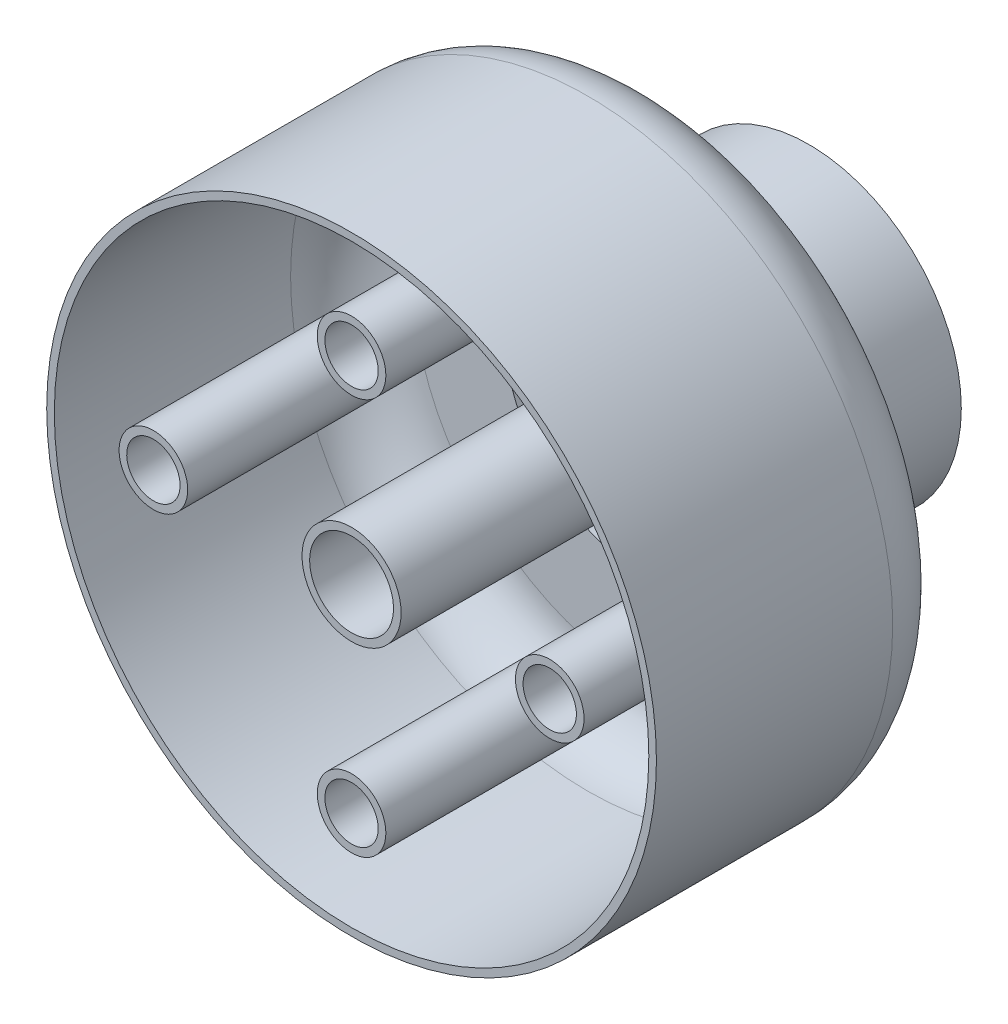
ISO-10303-21;
HEADER;
FILE_DESCRIPTION(('STEP AP214'),'2;1');
FILE_NAME('part.step','',(''),(''),'','','');
FILE_SCHEMA(('AUTOMOTIVE_DESIGN { 1 0 10303 214 1 1 1 1 }'));
ENDSEC;
DATA;
#1=APPLICATION_CONTEXT('core data for automotive mechanical design processes');
#2=APPLICATION_PROTOCOL_DEFINITION('international standard','automotive_design',2000,#1);
#3=PRODUCT_CONTEXT('',#1,'mechanical');
#4=PRODUCT('Part','Part','',(#3));
#5=PRODUCT_RELATED_PRODUCT_CATEGORY('part','',(#4));
#6=PRODUCT_DEFINITION_FORMATION('','',#4);
#7=PRODUCT_DEFINITION_CONTEXT('part definition',#1,'design');
#8=PRODUCT_DEFINITION('design','',#6,#7);
#9=PRODUCT_DEFINITION_SHAPE('','',#8);
#10=(LENGTH_UNIT() NAMED_UNIT(*) SI_UNIT(.MILLI.,.METRE.));
#11=(NAMED_UNIT(*) PLANE_ANGLE_UNIT() SI_UNIT($,.RADIAN.));
#12=(NAMED_UNIT(*) SI_UNIT($,.STERADIAN.) SOLID_ANGLE_UNIT());
#13=UNCERTAINTY_MEASURE_WITH_UNIT(LENGTH_MEASURE(1.E-05),#10,'distance_accuracy_value','');
#14=(GEOMETRIC_REPRESENTATION_CONTEXT(3) GLOBAL_UNCERTAINTY_ASSIGNED_CONTEXT((#13)) GLOBAL_UNIT_ASSIGNED_CONTEXT((#10,
#11,#12)) REPRESENTATION_CONTEXT('',''));
#15=CARTESIAN_POINT('',(0.,0.,0.));
#16=DIRECTION('',(0.,0.,1.));
#17=DIRECTION('',(1.,0.,0.));
#18=AXIS2_PLACEMENT_3D('',#15,#16,#17);
#19=CARTESIAN_POINT('',(0.,0.,15.));
#20=DIRECTION('',(0.,0.,1.));
#21=DIRECTION('',(1.,0.,0.));
#22=AXIS2_PLACEMENT_3D('',#19,#20,#21);
#23=PLANE('',#22);
#24=CARTESIAN_POINT('',(-6.5,0.,15.));
#25=DIRECTION('',(0.,0.,1.));
#26=DIRECTION('',(0.,1.,0.));
#27=AXIS2_PLACEMENT_3D('',#24,#25,#26);
#28=CIRCLE('',#27,0.875);
#29=CARTESIAN_POINT('',(-6.49999999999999,0.875000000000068,15.));
#30=VERTEX_POINT('',#29);
#31=EDGE_CURVE('E94',#30,#30,#28,.T.);
#32=ORIENTED_EDGE('',*,*,#31,.F.);
#33=EDGE_LOOP('',(#32));
#34=FACE_BOUND('',#33,.T.);
#35=CARTESIAN_POINT('',(-6.5,0.,15.));
#36=DIRECTION('',(0.,0.,1.));
#37=DIRECTION('',(1.,0.,0.));
#38=AXIS2_PLACEMENT_3D('',#35,#36,#37);
#39=CIRCLE('',#38,1.125);
#40=CARTESIAN_POINT('',(-5.375,0.,15.));
#41=VERTEX_POINT('',#40);
#42=EDGE_CURVE('E110',#41,#41,#39,.T.);
#43=ORIENTED_EDGE('',*,*,#42,.T.);
#44=EDGE_LOOP('',(#43));
#45=FACE_BOUND('',#44,.T.);
#46=ADVANCED_FACE('F32',(#34,#45),#23,.T.);
#47=CARTESIAN_POINT('',(0.,-6.5,15.));
#48=DIRECTION('',(0.,0.,1.));
#49=DIRECTION('',(-1.,0.,0.));
#50=AXIS2_PLACEMENT_3D('',#47,#48,#49);
#51=CIRCLE('',#50,0.875);
#52=CARTESIAN_POINT('',(-0.875,-6.5,15.));
#53=VERTEX_POINT('',#52);
#54=EDGE_CURVE('E88',#53,#53,#51,.T.);
#55=ORIENTED_EDGE('',*,*,#54,.F.);
#56=EDGE_LOOP('',(#55));
#57=FACE_BOUND('',#56,.T.);
#58=CARTESIAN_POINT('',(0.,-6.5,15.));
#59=DIRECTION('',(0.,0.,1.));
#60=DIRECTION('',(1.,0.,0.));
#61=AXIS2_PLACEMENT_3D('',#58,#59,#60);
#62=CIRCLE('',#61,1.125);
#63=CARTESIAN_POINT('',(1.125,-6.5,15.));
#64=VERTEX_POINT('',#63);
#65=EDGE_CURVE('E114',#64,#64,#62,.T.);
#66=ORIENTED_EDGE('',*,*,#65,.T.);
#67=EDGE_LOOP('',(#66));
#68=FACE_BOUND('',#67,.T.);
#69=ADVANCED_FACE('F162',(#57,#68),#23,.T.);
#70=CARTESIAN_POINT('',(6.5,0.,15.));
#71=DIRECTION('',(0.,0.,1.));
#72=DIRECTION('',(0.,-1.,0.));
#73=AXIS2_PLACEMENT_3D('',#70,#71,#72);
#74=CIRCLE('',#73,0.875);
#75=CARTESIAN_POINT('',(6.5,-0.875000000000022,15.));
#76=VERTEX_POINT('',#75);
#77=EDGE_CURVE('E82',#76,#76,#74,.T.);
#78=ORIENTED_EDGE('',*,*,#77,.F.);
#79=EDGE_LOOP('',(#78));
#80=FACE_BOUND('',#79,.T.);
#81=CARTESIAN_POINT('',(6.5,0.,15.));
#82=DIRECTION('',(0.,0.,1.));
#83=DIRECTION('',(1.,0.,0.));
#84=AXIS2_PLACEMENT_3D('',#81,#82,#83);
#85=CIRCLE('',#84,1.125);
#86=CARTESIAN_POINT('',(7.625,0.,15.));
#87=VERTEX_POINT('',#86);
#88=EDGE_CURVE('E118',#87,#87,#85,.T.);
#89=ORIENTED_EDGE('',*,*,#88,.T.);
#90=EDGE_LOOP('',(#89));
#91=FACE_BOUND('',#90,.T.);
#92=ADVANCED_FACE('F169',(#80,#91),#23,.T.);
#93=CARTESIAN_POINT('',(0.,6.5,15.));
#94=DIRECTION('',(0.,0.,1.));
#95=DIRECTION('',(1.,0.,0.));
#96=AXIS2_PLACEMENT_3D('',#93,#94,#95);
#97=CIRCLE('',#96,0.875);
#98=CARTESIAN_POINT('',(0.875,6.5,15.));
#99=VERTEX_POINT('',#98);
#100=EDGE_CURVE('E76',#99,#99,#97,.T.);
#101=ORIENTED_EDGE('',*,*,#100,.F.);
#102=EDGE_LOOP('',(#101));
#103=FACE_BOUND('',#102,.T.);
#104=CARTESIAN_POINT('',(0.,6.5,15.));
#105=DIRECTION('',(0.,0.,1.));
#106=DIRECTION('',(1.,0.,0.));
#107=AXIS2_PLACEMENT_3D('',#104,#105,#106);
#108=CIRCLE('',#107,1.125);
#109=CARTESIAN_POINT('',(1.125,6.5,15.));
#110=VERTEX_POINT('',#109);
#111=EDGE_CURVE('E122',#110,#110,#108,.T.);
#112=ORIENTED_EDGE('',*,*,#111,.T.);
#113=EDGE_LOOP('',(#112));
#114=FACE_BOUND('',#113,.T.);
#115=ADVANCED_FACE('F192',(#103,#114),#23,.T.);
#116=CARTESIAN_POINT('',(0.,0.,15.));
#117=DIRECTION('',(0.,0.,1.));
#118=DIRECTION('',(1.,0.,0.));
#119=AXIS2_PLACEMENT_3D('',#116,#117,#118);
#120=CIRCLE('',#119,1.625);
#121=CARTESIAN_POINT('',(1.625,0.,15.));
#122=VERTEX_POINT('',#121);
#123=EDGE_CURVE('E101',#122,#122,#120,.F.);
#124=ORIENTED_EDGE('',*,*,#123,.F.);
#125=EDGE_LOOP('',(#124));
#126=FACE_BOUND('',#125,.T.);
#127=CARTESIAN_POINT('',(0.,0.,15.));
#128=DIRECTION('',(0.,0.,-1.));
#129=DIRECTION('',(-1.,0.,0.));
#130=AXIS2_PLACEMENT_3D('',#127,#128,#129);
#131=CIRCLE('',#130,1.375);
#132=CARTESIAN_POINT('',(-1.375,0.,15.));
#133=VERTEX_POINT('',#132);
#134=EDGE_CURVE('E65',#133,#133,#131,.T.);
#135=ORIENTED_EDGE('',*,*,#134,.T.);
#136=EDGE_LOOP('',(#135));
#137=FACE_BOUND('',#136,.T.);
#138=ADVANCED_FACE('F179',(#126,#137),#23,.T.);
#139=CARTESIAN_POINT('',(0.,0.,1.));
#140=DIRECTION('',(0.,0.,-1.));
#141=DIRECTION('',(-1.,0.,0.));
#142=AXIS2_PLACEMENT_3D('',#139,#140,#141);
#143=PLANE('',#142);
#144=CARTESIAN_POINT('',(0.,0.,1.));
#145=DIRECTION('',(0.,0.,-1.));
#146=DIRECTION('',(-1.,0.,0.));
#147=AXIS2_PLACEMENT_3D('',#144,#145,#146);
#148=CIRCLE('',#147,4.75);
#149=CARTESIAN_POINT('',(-4.75,0.,1.));
#150=VERTEX_POINT('',#149);
#151=EDGE_CURVE('E55',#150,#150,#148,.T.);
#152=ORIENTED_EDGE('',*,*,#151,.T.);
#153=EDGE_LOOP('',(#152));
#154=FACE_BOUND('',#153,.T.);
#155=CARTESIAN_POINT('',(0.,0.,1.));
#156=DIRECTION('',(0.,0.,-1.));
#157=DIRECTION('',(-1.,0.,0.));
#158=AXIS2_PLACEMENT_3D('',#155,#156,#157);
#159=CIRCLE('',#158,1.875);
#160=CARTESIAN_POINT('',(-1.875,0.,1.));
#161=VERTEX_POINT('',#160);
#162=EDGE_CURVE('E62',#161,#161,#159,.T.);
#163=ORIENTED_EDGE('',*,*,#162,.F.);
#164=EDGE_LOOP('',(#163));
#165=FACE_BOUND('',#164,.T.);
#166=ADVANCED_FACE('F191',(#154,#165),#143,.T.);
#167=CARTESIAN_POINT('',(0.,0.,5.));
#168=DIRECTION('',(0.,0.,-1.));
#169=DIRECTION('',(-1.,0.,0.));
#170=AXIS2_PLACEMENT_3D('',#167,#168,#169);
#171=CYLINDRICAL_SURFACE('',#170,5.);
#172=CARTESIAN_POINT('',(0.,0.,5.));
#173=DIRECTION('',(0.,0.,1.));
#174=DIRECTION('',(1.,0.,0.));
#175=AXIS2_PLACEMENT_3D('',#172,#173,#174);
#176=CIRCLE('',#175,5.);
#177=CARTESIAN_POINT('',(5.,0.,5.));
#178=VERTEX_POINT('',#177);
#179=EDGE_CURVE('E43',#178,#178,#176,.T.);
#180=ORIENTED_EDGE('',*,*,#179,.F.);
#181=EDGE_LOOP('',(#180));
#182=FACE_BOUND('',#181,.T.);
#183=CARTESIAN_POINT('',(0.,0.,0.));
#184=DIRECTION('',(0.,0.,1.));
#185=DIRECTION('',(1.,0.,0.));
#186=AXIS2_PLACEMENT_3D('',#183,#184,#185);
#187=CIRCLE('',#186,5.);
#188=CARTESIAN_POINT('',(5.,0.,0.));
#189=VERTEX_POINT('',#188);
#190=EDGE_CURVE('E47',#189,#189,#187,.T.);
#191=ORIENTED_EDGE('',*,*,#190,.T.);
#192=EDGE_LOOP('',(#191));
#193=FACE_BOUND('',#192,.T.);
#194=ADVANCED_FACE('F198',(#182,#193),#171,.T.);
#195=CARTESIAN_POINT('',(0.,0.,0.));
#196=DIRECTION('',(0.,0.,1.));
#197=DIRECTION('',(1.,0.,0.));
#198=AXIS2_PLACEMENT_3D('',#195,#196,#197);
#199=PLANE('',#198);
#200=CARTESIAN_POINT('',(0.,0.,0.));
#201=DIRECTION('',(0.,0.,-1.));
#202=DIRECTION('',(-1.,0.,0.));
#203=AXIS2_PLACEMENT_3D('',#200,#201,#202);
#204=CIRCLE('',#203,4.75);
#205=CARTESIAN_POINT('',(-4.75,0.,0.));
#206=VERTEX_POINT('',#205);
#207=EDGE_CURVE('E56',#206,#206,#204,.T.);
#208=ORIENTED_EDGE('',*,*,#207,.F.);
#209=EDGE_LOOP('',(#208));
#210=FACE_BOUND('',#209,.T.);
#211=ORIENTED_EDGE('',*,*,#190,.F.);
#212=EDGE_LOOP('',(#211));
#213=FACE_BOUND('',#212,.T.);
#214=ADVANCED_FACE('F436',(#210,#213),#199,.F.);
#215=CARTESIAN_POINT('',(0.,0.,5.));
#216=DIRECTION('',(0.,0.,1.));
#217=DIRECTION('',(1.,0.,0.));
#218=AXIS2_PLACEMENT_3D('',#215,#216,#217);
#219=PLANE('',#218);
#220=CARTESIAN_POINT('',(0.,0.,5.));
#221=DIRECTION('',(0.,0.,1.));
#222=DIRECTION('',(1.,0.,0.));
#223=AXIS2_PLACEMENT_3D('',#220,#221,#222);
#224=CIRCLE('',#223,7.75);
#225=CARTESIAN_POINT('',(7.75,0.,5.));
#226=VERTEX_POINT('',#225);
#227=EDGE_CURVE('E10',#226,#226,#224,.F.);
#228=ORIENTED_EDGE('',*,*,#227,.T.);
#229=EDGE_LOOP('',(#228));
#230=FACE_BOUND('',#229,.T.);
#231=CARTESIAN_POINT('',(-6.5,0.,5.));
#232=DIRECTION('',(0.,0.,1.));
#233=DIRECTION('',(1.,0.,0.));
#234=AXIS2_PLACEMENT_3D('',#231,#232,#233);
#235=CIRCLE('',#234,0.875);
#236=CARTESIAN_POINT('',(-5.625,0.,5.));
#237=VERTEX_POINT('',#236);
#238=EDGE_CURVE('E91',#237,#237,#235,.T.);
#239=ORIENTED_EDGE('',*,*,#238,.T.);
#240=EDGE_LOOP('',(#239));
#241=FACE_BOUND('',#240,.T.);
#242=CARTESIAN_POINT('',(0.,-6.5,5.));
#243=DIRECTION('',(0.,0.,1.));
#244=DIRECTION('',(1.,0.,0.));
#245=AXIS2_PLACEMENT_3D('',#242,#243,#244);
#246=CIRCLE('',#245,0.875);
#247=CARTESIAN_POINT('',(0.875,-6.5,5.));
#248=VERTEX_POINT('',#247);
#249=EDGE_CURVE('E85',#248,#248,#246,.T.);
#250=ORIENTED_EDGE('',*,*,#249,.T.);
#251=EDGE_LOOP('',(#250));
#252=FACE_BOUND('',#251,.T.);
#253=CARTESIAN_POINT('',(6.5,0.,5.));
#254=DIRECTION('',(0.,0.,1.));
#255=DIRECTION('',(1.,0.,0.));
#256=AXIS2_PLACEMENT_3D('',#253,#254,#255);
#257=CIRCLE('',#256,0.875);
#258=CARTESIAN_POINT('',(7.375,0.,5.));
#259=VERTEX_POINT('',#258);
#260=EDGE_CURVE('E79',#259,#259,#257,.T.);
#261=ORIENTED_EDGE('',*,*,#260,.T.);
#262=EDGE_LOOP('',(#261));
#263=FACE_BOUND('',#262,.T.);
#264=CARTESIAN_POINT('',(0.,6.5,5.));
#265=DIRECTION('',(0.,0.,1.));
#266=DIRECTION('',(1.,0.,0.));
#267=AXIS2_PLACEMENT_3D('',#264,#265,#266);
#268=CIRCLE('',#267,0.875);
#269=CARTESIAN_POINT('',(0.875,6.5,5.));
#270=VERTEX_POINT('',#269);
#271=EDGE_CURVE('E71',#270,#270,#268,.T.);
#272=ORIENTED_EDGE('',*,*,#271,.T.);
#273=EDGE_LOOP('',(#272));
#274=FACE_BOUND('',#273,.T.);
#275=ORIENTED_EDGE('',*,*,#179,.T.);
#276=EDGE_LOOP('',(#275));
#277=FACE_BOUND('',#276,.T.);
#278=ADVANCED_FACE('F186',(#230,#241,#252,#263,#274,#277),#219,.F.);
#279=CARTESIAN_POINT('',(0.,0.,15.));
#280=DIRECTION('',(0.,0.,-1.));
#281=DIRECTION('',(-1.,0.,0.));
#282=AXIS2_PLACEMENT_3D('',#279,#280,#281);
#283=CYLINDRICAL_SURFACE('',#282,10.);
#284=CARTESIAN_POINT('',(0.,0.,7.25));
#285=DIRECTION('',(0.,0.,1.));
#286=DIRECTION('',(1.,0.,0.));
#287=AXIS2_PLACEMENT_3D('',#284,#285,#286);
#288=CIRCLE('',#287,10.);
#289=CARTESIAN_POINT('',(10.,0.,7.25));
#290=VERTEX_POINT('',#289);
#291=EDGE_CURVE('E39',#290,#290,#288,.T.);
#292=ORIENTED_EDGE('',*,*,#291,.T.);
#293=EDGE_LOOP('',(#292));
#294=FACE_BOUND('',#293,.T.);
#295=CARTESIAN_POINT('',(0.,0.,15.));
#296=DIRECTION('',(0.,0.,1.));
#297=DIRECTION('',(1.,0.,0.));
#298=AXIS2_PLACEMENT_3D('',#295,#296,#297);
#299=CIRCLE('',#298,10.);
#300=CARTESIAN_POINT('',(10.,0.,15.));
#301=VERTEX_POINT('',#300);
#302=EDGE_CURVE('E51',#301,#301,#299,.T.);
#303=ORIENTED_EDGE('',*,*,#302,.F.);
#304=EDGE_LOOP('',(#303));
#305=FACE_BOUND('',#304,.T.);
#306=ADVANCED_FACE('F177',(#294,#305),#283,.T.);
#307=CARTESIAN_POINT('',(0.,0.,15.));
#308=DIRECTION('',(0.,0.,1.));
#309=DIRECTION('',(1.,0.,0.));
#310=AXIS2_PLACEMENT_3D('',#307,#308,#309);
#311=CIRCLE('',#310,9.75);
#312=CARTESIAN_POINT('',(9.75,0.,15.));
#313=VERTEX_POINT('',#312);
#314=EDGE_CURVE('E106',#313,#313,#311,.T.);
#315=ORIENTED_EDGE('',*,*,#314,.F.);
#316=EDGE_LOOP('',(#315));
#317=FACE_BOUND('',#316,.T.);
#318=ORIENTED_EDGE('',*,*,#302,.T.);
#319=EDGE_LOOP('',(#318));
#320=FACE_BOUND('',#319,.T.);
#321=ADVANCED_FACE('F165',(#317,#320),#23,.T.);
#322=CARTESIAN_POINT('',(0.,0.,1.));
#323=DIRECTION('',(0.,0.,-1.));
#324=DIRECTION('',(-1.,0.,0.));
#325=AXIS2_PLACEMENT_3D('',#322,#323,#324);
#326=CYLINDRICAL_SURFACE('',#325,4.75);
#327=ORIENTED_EDGE('',*,*,#151,.F.);
#328=EDGE_LOOP('',(#327));
#329=FACE_BOUND('',#328,.T.);
#330=ORIENTED_EDGE('',*,*,#207,.T.);
#331=EDGE_LOOP('',(#330));
#332=FACE_BOUND('',#331,.T.);
#333=ADVANCED_FACE('F176',(#329,#332),#326,.F.);
#334=CARTESIAN_POINT('',(0.,0.,0.75));
#335=DIRECTION('',(0.,0.,1.));
#336=DIRECTION('',(1.,0.,0.));
#337=AXIS2_PLACEMENT_3D('',#334,#335,#336);
#338=CYLINDRICAL_SURFACE('',#337,1.875);
#339=CARTESIAN_POINT('',(0.,0.,0.75));
#340=DIRECTION('',(0.,0.,-1.));
#341=DIRECTION('',(-1.,0.,0.));
#342=AXIS2_PLACEMENT_3D('',#339,#340,#341);
#343=CIRCLE('',#342,1.875);
#344=CARTESIAN_POINT('',(-1.875,0.,0.75));
#345=VERTEX_POINT('',#344);
#346=EDGE_CURVE('E59',#345,#345,#343,.T.);
#347=ORIENTED_EDGE('',*,*,#346,.F.);
#348=EDGE_LOOP('',(#347));
#349=FACE_BOUND('',#348,.T.);
#350=ORIENTED_EDGE('',*,*,#162,.T.);
#351=EDGE_LOOP('',(#350));
#352=FACE_BOUND('',#351,.T.);
#353=ADVANCED_FACE('F184',(#349,#352),#338,.T.);
#354=CARTESIAN_POINT('',(0.,0.,0.75));
#355=DIRECTION('',(0.,0.,-1.));
#356=DIRECTION('',(-1.,0.,0.));
#357=AXIS2_PLACEMENT_3D('',#354,#355,#356);
#358=PLANE('',#357);
#359=CARTESIAN_POINT('',(0.,0.,0.75));
#360=DIRECTION('',(0.,0.,-1.));
#361=DIRECTION('',(-1.,0.,0.));
#362=AXIS2_PLACEMENT_3D('',#359,#360,#361);
#363=CIRCLE('',#362,1.375);
#364=CARTESIAN_POINT('',(-1.375,0.,0.75));
#365=VERTEX_POINT('',#364);
#366=EDGE_CURVE('E68',#365,#365,#363,.T.);
#367=ORIENTED_EDGE('',*,*,#366,.F.);
#368=EDGE_LOOP('',(#367));
#369=FACE_BOUND('',#368,.T.);
#370=ORIENTED_EDGE('',*,*,#346,.T.);
#371=EDGE_LOOP('',(#370));
#372=FACE_BOUND('',#371,.T.);
#373=ADVANCED_FACE('F210',(#369,#372),#358,.T.);
#374=CARTESIAN_POINT('',(0.,0.,15.));
#375=DIRECTION('',(0.,0.,-1.));
#376=DIRECTION('',(-1.,0.,0.));
#377=AXIS2_PLACEMENT_3D('',#374,#375,#376);
#378=CYLINDRICAL_SURFACE('',#377,1.375);
#379=ORIENTED_EDGE('',*,*,#134,.F.);
#380=EDGE_LOOP('',(#379));
#381=FACE_BOUND('',#380,.T.);
#382=ORIENTED_EDGE('',*,*,#366,.T.);
#383=EDGE_LOOP('',(#382));
#384=FACE_BOUND('',#383,.T.);
#385=ADVANCED_FACE('F206',(#381,#384),#378,.F.);
#386=CARTESIAN_POINT('',(0.,6.5,0.));
#387=DIRECTION('',(0.,0.,1.));
#388=DIRECTION('',(1.,0.,0.));
#389=AXIS2_PLACEMENT_3D('',#386,#387,#388);
#390=CYLINDRICAL_SURFACE('',#389,0.875);
#391=ORIENTED_EDGE('',*,*,#100,.T.);
#392=EDGE_LOOP('',(#391));
#393=FACE_BOUND('',#392,.T.);
#394=ORIENTED_EDGE('',*,*,#271,.F.);
#395=EDGE_LOOP('',(#394));
#396=FACE_BOUND('',#395,.T.);
#397=ADVANCED_FACE('F209',(#393,#396),#390,.F.);
#398=CARTESIAN_POINT('',(6.5,0.,0.));
#399=DIRECTION('',(0.,0.,1.));
#400=DIRECTION('',(1.,0.,0.));
#401=AXIS2_PLACEMENT_3D('',#398,#399,#400);
#402=CYLINDRICAL_SURFACE('',#401,0.875);
#403=ORIENTED_EDGE('',*,*,#77,.T.);
#404=EDGE_LOOP('',(#403));
#405=FACE_BOUND('',#404,.T.);
#406=ORIENTED_EDGE('',*,*,#260,.F.);
#407=EDGE_LOOP('',(#406));
#408=FACE_BOUND('',#407,.T.);
#409=ADVANCED_FACE('F229',(#405,#408),#402,.F.);
#410=CARTESIAN_POINT('',(0.,-6.5,0.));
#411=DIRECTION('',(0.,0.,1.));
#412=DIRECTION('',(1.,0.,0.));
#413=AXIS2_PLACEMENT_3D('',#410,#411,#412);
#414=CYLINDRICAL_SURFACE('',#413,0.875);
#415=ORIENTED_EDGE('',*,*,#54,.T.);
#416=EDGE_LOOP('',(#415));
#417=FACE_BOUND('',#416,.T.);
#418=ORIENTED_EDGE('',*,*,#249,.F.);
#419=EDGE_LOOP('',(#418));
#420=FACE_BOUND('',#419,.T.);
#421=ADVANCED_FACE('F233',(#417,#420),#414,.F.);
#422=CARTESIAN_POINT('',(-6.5,0.,0.));
#423=DIRECTION('',(0.,0.,1.));
#424=DIRECTION('',(1.,0.,0.));
#425=AXIS2_PLACEMENT_3D('',#422,#423,#424);
#426=CYLINDRICAL_SURFACE('',#425,0.875);
#427=ORIENTED_EDGE('',*,*,#31,.T.);
#428=EDGE_LOOP('',(#427));
#429=FACE_BOUND('',#428,.T.);
#430=ORIENTED_EDGE('',*,*,#238,.F.);
#431=EDGE_LOOP('',(#430));
#432=FACE_BOUND('',#431,.T.);
#433=ADVANCED_FACE('F237',(#429,#432),#426,.F.);
#434=CARTESIAN_POINT('',(0.,0.,7.25));
#435=DIRECTION('',(0.,0.,1.));
#436=DIRECTION('',(1.,0.,0.));
#437=AXIS2_PLACEMENT_3D('',#434,#435,#436);
#438=TOROIDAL_SURFACE('',#437,7.75,2.25);
#439=ORIENTED_EDGE('',*,*,#227,.F.);
#440=EDGE_LOOP('',(#439));
#441=FACE_BOUND('',#440,.T.);
#442=ORIENTED_EDGE('',*,*,#291,.F.);
#443=EDGE_LOOP('',(#442));
#444=FACE_BOUND('',#443,.T.);
#445=ADVANCED_FACE('F34',(#441,#444),#438,.T.);
#446=CARTESIAN_POINT('',(0.,0.,5.));
#447=DIRECTION('',(0.,0.,-1.));
#448=DIRECTION('',(-1.,0.,0.));
#449=AXIS2_PLACEMENT_3D('',#446,#447,#448);
#450=CYLINDRICAL_SURFACE('',#449,4.75);
#451=CARTESIAN_POINT('',(0.,0.,5.25));
#452=DIRECTION('',(0.,0.,1.));
#453=DIRECTION('',(1.,0.,0.));
#454=AXIS2_PLACEMENT_3D('',#451,#452,#453);
#455=CIRCLE('',#454,4.75);
#456=CARTESIAN_POINT('',(4.75,0.,5.25));
#457=VERTEX_POINT('',#456);
#458=EDGE_CURVE('E109',#457,#457,#455,.T.);
#459=ORIENTED_EDGE('',*,*,#458,.T.);
#460=EDGE_LOOP('',(#459));
#461=FACE_BOUND('',#460,.T.);
#462=CARTESIAN_POINT('',(0.,0.,1.25));
#463=DIRECTION('',(0.,0.,-1.));
#464=DIRECTION('',(-1.,0.,0.));
#465=AXIS2_PLACEMENT_3D('',#462,#463,#464);
#466=CIRCLE('',#465,4.75);
#467=CARTESIAN_POINT('',(-4.75,0.,1.25));
#468=VERTEX_POINT('',#467);
#469=EDGE_CURVE('E97',#468,#468,#466,.F.);
#470=ORIENTED_EDGE('',*,*,#469,.F.);
#471=EDGE_LOOP('',(#470));
#472=FACE_BOUND('',#471,.T.);
#473=ADVANCED_FACE('F147',(#461,#472),#450,.F.);
#474=CARTESIAN_POINT('',(0.,0.,15.));
#475=DIRECTION('',(0.,0.,-1.));
#476=DIRECTION('',(-1.,0.,0.));
#477=AXIS2_PLACEMENT_3D('',#474,#475,#476);
#478=CYLINDRICAL_SURFACE('',#477,1.625);
#479=ORIENTED_EDGE('',*,*,#123,.T.);
#480=EDGE_LOOP('',(#479));
#481=FACE_BOUND('',#480,.T.);
#482=CARTESIAN_POINT('',(0.,0.,1.25));
#483=DIRECTION('',(0.,0.,-1.));
#484=DIRECTION('',(-1.,0.,0.));
#485=AXIS2_PLACEMENT_3D('',#482,#483,#484);
#486=CIRCLE('',#485,1.625);
#487=CARTESIAN_POINT('',(-1.625,0.,1.25));
#488=VERTEX_POINT('',#487);
#489=EDGE_CURVE('E104',#488,#488,#486,.T.);
#490=ORIENTED_EDGE('',*,*,#489,.F.);
#491=EDGE_LOOP('',(#490));
#492=FACE_BOUND('',#491,.T.);
#493=ADVANCED_FACE('F145',(#481,#492),#478,.T.);
#494=CARTESIAN_POINT('',(0.,0.,1.25));
#495=DIRECTION('',(0.,0.,-1.));
#496=DIRECTION('',(-1.,0.,0.));
#497=AXIS2_PLACEMENT_3D('',#494,#495,#496);
#498=PLANE('',#497);
#499=ORIENTED_EDGE('',*,*,#469,.T.);
#500=EDGE_LOOP('',(#499));
#501=FACE_BOUND('',#500,.T.);
#502=ORIENTED_EDGE('',*,*,#489,.T.);
#503=EDGE_LOOP('',(#502));
#504=FACE_BOUND('',#503,.T.);
#505=ADVANCED_FACE('F143',(#501,#504),#498,.F.);
#506=CARTESIAN_POINT('',(0.,0.,5.25));
#507=DIRECTION('',(0.,0.,1.));
#508=DIRECTION('',(1.,0.,0.));
#509=AXIS2_PLACEMENT_3D('',#506,#507,#508);
#510=PLANE('',#509);
#511=CARTESIAN_POINT('',(0.,0.,5.25));
#512=DIRECTION('',(0.,0.,1.));
#513=DIRECTION('',(1.,0.,0.));
#514=AXIS2_PLACEMENT_3D('',#511,#512,#513);
#515=CIRCLE('',#514,7.75);
#516=CARTESIAN_POINT('',(7.75,0.,5.25));
#517=VERTEX_POINT('',#516);
#518=EDGE_CURVE('E100',#517,#517,#515,.F.);
#519=ORIENTED_EDGE('',*,*,#518,.F.);
#520=EDGE_LOOP('',(#519));
#521=FACE_BOUND('',#520,.T.);
#522=CARTESIAN_POINT('',(-6.5,0.,5.25));
#523=DIRECTION('',(0.,0.,1.));
#524=DIRECTION('',(1.,0.,0.));
#525=AXIS2_PLACEMENT_3D('',#522,#523,#524);
#526=CIRCLE('',#525,1.125);
#527=CARTESIAN_POINT('',(-5.375,0.,5.25));
#528=VERTEX_POINT('',#527);
#529=EDGE_CURVE('E113',#528,#528,#526,.T.);
#530=ORIENTED_EDGE('',*,*,#529,.F.);
#531=EDGE_LOOP('',(#530));
#532=FACE_BOUND('',#531,.T.);
#533=CARTESIAN_POINT('',(0.,-6.5,5.25));
#534=DIRECTION('',(0.,0.,1.));
#535=DIRECTION('',(1.,0.,0.));
#536=AXIS2_PLACEMENT_3D('',#533,#534,#535);
#537=CIRCLE('',#536,1.125);
#538=CARTESIAN_POINT('',(1.125,-6.5,5.25));
#539=VERTEX_POINT('',#538);
#540=EDGE_CURVE('E117',#539,#539,#537,.T.);
#541=ORIENTED_EDGE('',*,*,#540,.F.);
#542=EDGE_LOOP('',(#541));
#543=FACE_BOUND('',#542,.T.);
#544=CARTESIAN_POINT('',(6.5,0.,5.25));
#545=DIRECTION('',(0.,0.,1.));
#546=DIRECTION('',(1.,0.,0.));
#547=AXIS2_PLACEMENT_3D('',#544,#545,#546);
#548=CIRCLE('',#547,1.125);
#549=CARTESIAN_POINT('',(7.625,0.,5.25));
#550=VERTEX_POINT('',#549);
#551=EDGE_CURVE('E121',#550,#550,#548,.T.);
#552=ORIENTED_EDGE('',*,*,#551,.F.);
#553=EDGE_LOOP('',(#552));
#554=FACE_BOUND('',#553,.T.);
#555=CARTESIAN_POINT('',(0.,6.5,5.25));
#556=DIRECTION('',(0.,0.,1.));
#557=DIRECTION('',(1.,0.,0.));
#558=AXIS2_PLACEMENT_3D('',#555,#556,#557);
#559=CIRCLE('',#558,1.125);
#560=CARTESIAN_POINT('',(1.125,6.5,5.25));
#561=VERTEX_POINT('',#560);
#562=EDGE_CURVE('E105',#561,#561,#559,.T.);
#563=ORIENTED_EDGE('',*,*,#562,.F.);
#564=EDGE_LOOP('',(#563));
#565=FACE_BOUND('',#564,.T.);
#566=ORIENTED_EDGE('',*,*,#458,.F.);
#567=EDGE_LOOP('',(#566));
#568=FACE_BOUND('',#567,.T.);
#569=ADVANCED_FACE('F154',(#521,#532,#543,#554,#565,#568),#510,.T.);
#570=CARTESIAN_POINT('',(0.,0.,15.));
#571=DIRECTION('',(0.,0.,-1.));
#572=DIRECTION('',(-1.,0.,0.));
#573=AXIS2_PLACEMENT_3D('',#570,#571,#572);
#574=CYLINDRICAL_SURFACE('',#573,9.75);
#575=CARTESIAN_POINT('',(0.,0.,7.25));
#576=DIRECTION('',(0.,0.,-1.));
#577=DIRECTION('',(-1.,0.,0.));
#578=AXIS2_PLACEMENT_3D('',#575,#576,#577);
#579=CIRCLE('',#578,9.75);
#580=CARTESIAN_POINT('',(-9.75,0.,7.25));
#581=VERTEX_POINT('',#580);
#582=EDGE_CURVE('E125',#581,#581,#579,.F.);
#583=ORIENTED_EDGE('',*,*,#582,.F.);
#584=EDGE_LOOP('',(#583));
#585=FACE_BOUND('',#584,.T.);
#586=ORIENTED_EDGE('',*,*,#314,.T.);
#587=EDGE_LOOP('',(#586));
#588=FACE_BOUND('',#587,.T.);
#589=ADVANCED_FACE('F259',(#585,#588),#574,.F.);
#590=CARTESIAN_POINT('',(0.,6.5,0.));
#591=DIRECTION('',(0.,0.,1.));
#592=DIRECTION('',(1.,0.,0.));
#593=AXIS2_PLACEMENT_3D('',#590,#591,#592);
#594=CYLINDRICAL_SURFACE('',#593,1.125);
#595=ORIENTED_EDGE('',*,*,#111,.F.);
#596=EDGE_LOOP('',(#595));
#597=FACE_BOUND('',#596,.T.);
#598=ORIENTED_EDGE('',*,*,#562,.T.);
#599=EDGE_LOOP('',(#598));
#600=FACE_BOUND('',#599,.T.);
#601=ADVANCED_FACE('F256',(#597,#600),#594,.T.);
#602=CARTESIAN_POINT('',(6.5,0.,0.));
#603=DIRECTION('',(0.,0.,1.));
#604=DIRECTION('',(1.,0.,0.));
#605=AXIS2_PLACEMENT_3D('',#602,#603,#604);
#606=CYLINDRICAL_SURFACE('',#605,1.125);
#607=ORIENTED_EDGE('',*,*,#88,.F.);
#608=EDGE_LOOP('',(#607));
#609=FACE_BOUND('',#608,.T.);
#610=ORIENTED_EDGE('',*,*,#551,.T.);
#611=EDGE_LOOP('',(#610));
#612=FACE_BOUND('',#611,.T.);
#613=ADVANCED_FACE('F253',(#609,#612),#606,.T.);
#614=CARTESIAN_POINT('',(0.,-6.5,0.));
#615=DIRECTION('',(0.,0.,1.));
#616=DIRECTION('',(1.,0.,0.));
#617=AXIS2_PLACEMENT_3D('',#614,#615,#616);
#618=CYLINDRICAL_SURFACE('',#617,1.125);
#619=ORIENTED_EDGE('',*,*,#65,.F.);
#620=EDGE_LOOP('',(#619));
#621=FACE_BOUND('',#620,.T.);
#622=ORIENTED_EDGE('',*,*,#540,.T.);
#623=EDGE_LOOP('',(#622));
#624=FACE_BOUND('',#623,.T.);
#625=ADVANCED_FACE('F249',(#621,#624),#618,.T.);
#626=CARTESIAN_POINT('',(-6.5,0.,0.));
#627=DIRECTION('',(0.,0.,1.));
#628=DIRECTION('',(1.,0.,0.));
#629=AXIS2_PLACEMENT_3D('',#626,#627,#628);
#630=CYLINDRICAL_SURFACE('',#629,1.125);
#631=ORIENTED_EDGE('',*,*,#42,.F.);
#632=EDGE_LOOP('',(#631));
#633=FACE_BOUND('',#632,.T.);
#634=ORIENTED_EDGE('',*,*,#529,.T.);
#635=EDGE_LOOP('',(#634));
#636=FACE_BOUND('',#635,.T.);
#637=ADVANCED_FACE('F245',(#633,#636),#630,.T.);
#638=CARTESIAN_POINT('',(0.,0.,7.25));
#639=DIRECTION('',(0.,0.,1.));
#640=DIRECTION('',(1.,0.,0.));
#641=AXIS2_PLACEMENT_3D('',#638,#639,#640);
#642=TOROIDAL_SURFACE('',#641,7.75,2.);
#643=ORIENTED_EDGE('',*,*,#518,.T.);
#644=EDGE_LOOP('',(#643));
#645=FACE_BOUND('',#644,.T.);
#646=ORIENTED_EDGE('',*,*,#582,.T.);
#647=EDGE_LOOP('',(#646));
#648=FACE_BOUND('',#647,.T.);
#649=ADVANCED_FACE('F242',(#645,#648),#642,.F.);
#650=CLOSED_SHELL('',(#46,#69,#92,#115,#138,#166,#194,#214,#278,#306,#321,#333,#353,#373,#385,
#397,#409,#421,#433,#445,#473,#493,#505,#569,#589,#601,#613,#625,#637,#649));
#651=MANIFOLD_SOLID_BREP('B2',#650);
#652=ADVANCED_BREP_SHAPE_REPRESENTATION('',(#18,#651),#14);
#653=SHAPE_DEFINITION_REPRESENTATION(#9,#652);
ENDSEC;
END-ISO-10303-21;
